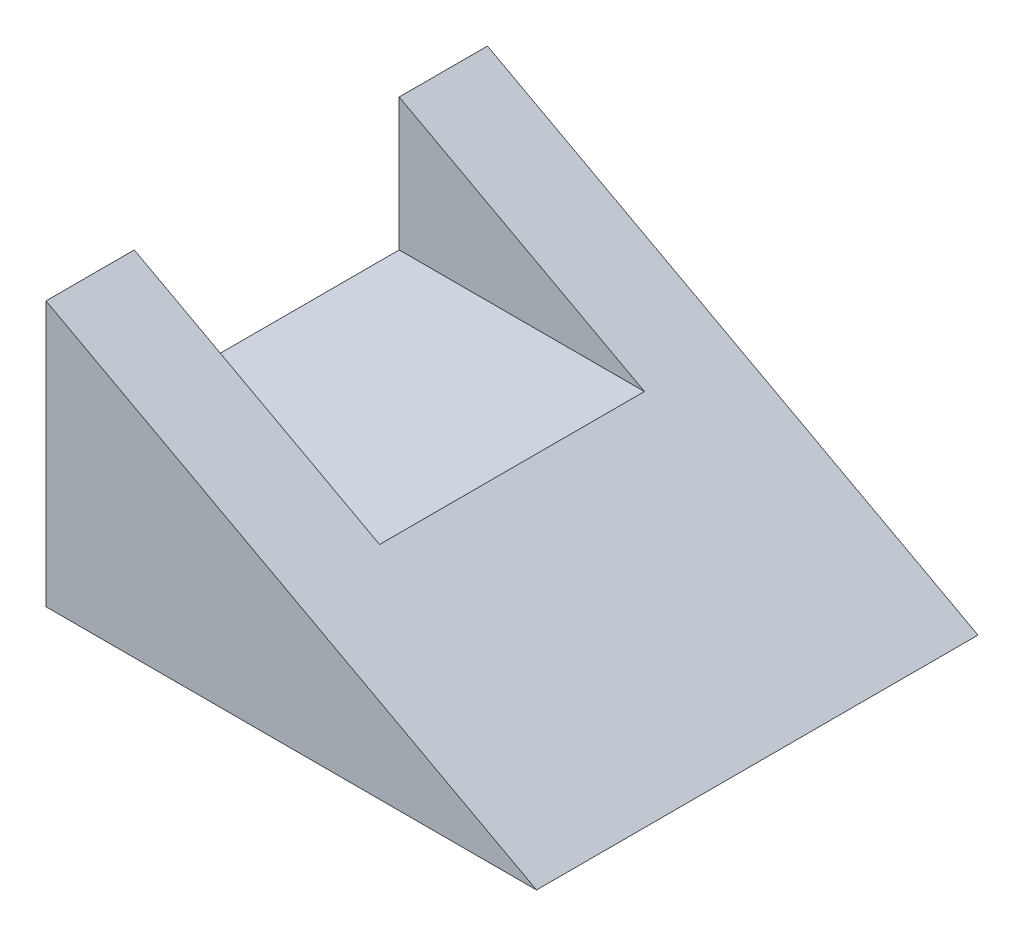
ISO-10303-21;
HEADER;
FILE_DESCRIPTION(('STEP AP214'),'2;1');
FILE_NAME('part.step','',(''),(''),'','','');
FILE_SCHEMA(('AUTOMOTIVE_DESIGN { 1 0 10303 214 1 1 1 1 }'));
ENDSEC;
DATA;
#1=APPLICATION_CONTEXT('core data for automotive mechanical design processes');
#2=APPLICATION_PROTOCOL_DEFINITION('international standard','automotive_design',2000,#1);
#3=PRODUCT_CONTEXT('',#1,'mechanical');
#4=PRODUCT('Part','Part','',(#3));
#5=PRODUCT_RELATED_PRODUCT_CATEGORY('part','',(#4));
#6=PRODUCT_DEFINITION_FORMATION('','',#4);
#7=PRODUCT_DEFINITION_CONTEXT('part definition',#1,'design');
#8=PRODUCT_DEFINITION('design','',#6,#7);
#9=PRODUCT_DEFINITION_SHAPE('','',#8);
#10=(LENGTH_UNIT() NAMED_UNIT(*) SI_UNIT(.MILLI.,.METRE.));
#11=(NAMED_UNIT(*) PLANE_ANGLE_UNIT() SI_UNIT($,.RADIAN.));
#12=(NAMED_UNIT(*) SI_UNIT($,.STERADIAN.) SOLID_ANGLE_UNIT());
#13=UNCERTAINTY_MEASURE_WITH_UNIT(LENGTH_MEASURE(1.E-05),#10,'distance_accuracy_value','');
#14=(GEOMETRIC_REPRESENTATION_CONTEXT(3) GLOBAL_UNCERTAINTY_ASSIGNED_CONTEXT((#13)) GLOBAL_UNIT_ASSIGNED_CONTEXT((#10,
#11,#12)) REPRESENTATION_CONTEXT('',''));
#15=CARTESIAN_POINT('',(0.,0.,0.));
#16=DIRECTION('',(0.,0.,1.));
#17=DIRECTION('',(1.,0.,0.));
#18=AXIS2_PLACEMENT_3D('',#15,#16,#17);
#19=CARTESIAN_POINT('',(50.,0.,45.));
#20=DIRECTION('',(0.,1.,0.));
#21=DIRECTION('',(-1.,0.,0.));
#22=AXIS2_PLACEMENT_3D('',#19,#20,#21);
#23=PLANE('',#22);
#24=DIRECTION('',(1.,0.,0.));
#25=VECTOR('',#24,1.);
#26=CARTESIAN_POINT('',(50.,0.,0.));
#27=LINE('',#26,#25);
#28=CARTESIAN_POINT('',(0.,0.,0.));
#29=VERTEX_POINT('',#28);
#30=CARTESIAN_POINT('',(50.,0.,0.));
#31=VERTEX_POINT('',#30);
#32=EDGE_CURVE('E110',#29,#31,#27,.T.);
#33=ORIENTED_EDGE('',*,*,#32,.T.);
#34=DIRECTION('',(0.,0.,-1.));
#35=VECTOR('',#34,1.);
#36=CARTESIAN_POINT('',(50.,0.,45.));
#37=LINE('',#36,#35);
#38=CARTESIAN_POINT('',(50.,0.,45.));
#39=VERTEX_POINT('',#38);
#40=EDGE_CURVE('E38',#39,#31,#37,.T.);
#41=ORIENTED_EDGE('',*,*,#40,.F.);
#42=DIRECTION('',(1.,0.,0.));
#43=VECTOR('',#42,1.);
#44=CARTESIAN_POINT('',(50.,0.,45.));
#45=LINE('',#44,#43);
#46=CARTESIAN_POINT('',(0.,0.,45.));
#47=VERTEX_POINT('',#46);
#48=EDGE_CURVE('E118',#47,#39,#45,.T.);
#49=ORIENTED_EDGE('',*,*,#48,.F.);
#50=DIRECTION('',(0.,0.,-1.));
#51=VECTOR('',#50,1.);
#52=CARTESIAN_POINT('',(0.,0.,45.));
#53=LINE('',#52,#51);
#54=EDGE_CURVE('E123',#47,#29,#53,.T.);
#55=ORIENTED_EDGE('',*,*,#54,.T.);
#56=EDGE_LOOP('',(#33,#41,#49,#55));
#57=FACE_BOUND('',#56,.T.);
#58=ADVANCED_FACE('F31',(#57),#23,.F.);
#59=CARTESIAN_POINT('',(0.,27.,45.));
#60=DIRECTION('',(-0.475148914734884,-0.879905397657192,0.));
#61=DIRECTION('',(0.879905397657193,-0.475148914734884,0.));
#62=AXIS2_PLACEMENT_3D('',#59,#60,#61);
#63=PLANE('',#62);
#64=DIRECTION('',(0.,0.,-1.));
#65=VECTOR('',#64,1.);
#66=CARTESIAN_POINT('',(0.,27.,45.));
#67=LINE('',#66,#65);
#68=CARTESIAN_POINT('',(0.,27.,9.));
#69=VERTEX_POINT('',#68);
#70=CARTESIAN_POINT('',(0.,27.,0.));
#71=VERTEX_POINT('',#70);
#72=EDGE_CURVE('E126',#69,#71,#67,.T.);
#73=ORIENTED_EDGE('',*,*,#72,.F.);
#74=DIRECTION('',(0.879905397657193,-0.475148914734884,0.));
#75=VECTOR('',#74,1.);
#76=CARTESIAN_POINT('',(0.,27.,9.));
#77=LINE('',#76,#75);
#78=CARTESIAN_POINT('',(25.,13.5,9.));
#79=VERTEX_POINT('',#78);
#80=EDGE_CURVE('E107',#69,#79,#77,.T.);
#81=ORIENTED_EDGE('',*,*,#80,.T.);
#82=DIRECTION('',(0.,0.,1.));
#83=VECTOR('',#82,1.);
#84=CARTESIAN_POINT('',(25.,13.5,45.));
#85=LINE('',#84,#83);
#86=CARTESIAN_POINT('',(25.,13.5,36.));
#87=VERTEX_POINT('',#86);
#88=EDGE_CURVE('E91',#79,#87,#85,.T.);
#89=ORIENTED_EDGE('',*,*,#88,.T.);
#90=DIRECTION('',(-0.879905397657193,0.475148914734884,0.));
#91=VECTOR('',#90,1.);
#92=CARTESIAN_POINT('',(0.,27.,36.));
#93=LINE('',#92,#91);
#94=CARTESIAN_POINT('',(0.,27.,36.));
#95=VERTEX_POINT('',#94);
#96=EDGE_CURVE('E89',#87,#95,#93,.T.);
#97=ORIENTED_EDGE('',*,*,#96,.T.);
#98=CARTESIAN_POINT('',(0.,27.,45.));
#99=VERTEX_POINT('',#98);
#100=EDGE_CURVE('E101',#99,#95,#67,.T.);
#101=ORIENTED_EDGE('',*,*,#100,.F.);
#102=DIRECTION('',(-0.879905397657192,0.475148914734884,0.));
#103=VECTOR('',#102,1.);
#104=CARTESIAN_POINT('',(0.,27.,45.));
#105=LINE('',#104,#103);
#106=EDGE_CURVE('E120',#39,#99,#105,.T.);
#107=ORIENTED_EDGE('',*,*,#106,.F.);
#108=ORIENTED_EDGE('',*,*,#40,.T.);
#109=DIRECTION('',(-0.879905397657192,0.475148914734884,0.));
#110=VECTOR('',#109,1.);
#111=CARTESIAN_POINT('',(0.,27.,0.));
#112=LINE('',#111,#110);
#113=EDGE_CURVE('E113',#31,#71,#112,.T.);
#114=ORIENTED_EDGE('',*,*,#113,.T.);
#115=EDGE_LOOP('',(#73,#81,#89,#97,#101,#107,#108,#114));
#116=FACE_BOUND('',#115,.T.);
#117=ADVANCED_FACE('F131',(#116),#63,.F.);
#118=CARTESIAN_POINT('',(0.,0.,45.));
#119=DIRECTION('',(1.,0.,0.));
#120=DIRECTION('',(0.,0.,-1.));
#121=AXIS2_PLACEMENT_3D('',#118,#119,#120);
#122=PLANE('',#121);
#123=DIRECTION('',(0.,0.,1.));
#124=VECTOR('',#123,1.);
#125=CARTESIAN_POINT('',(0.,13.5,9.));
#126=LINE('',#125,#124);
#127=CARTESIAN_POINT('',(0.,13.5,9.));
#128=VERTEX_POINT('',#127);
#129=CARTESIAN_POINT('',(0.,13.5,36.));
#130=VERTEX_POINT('',#129);
#131=EDGE_CURVE('E94',#128,#130,#126,.T.);
#132=ORIENTED_EDGE('',*,*,#131,.F.);
#133=DIRECTION('',(0.,1.,0.));
#134=VECTOR('',#133,1.);
#135=CARTESIAN_POINT('',(0.,0.,9.00000000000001));
#136=LINE('',#135,#134);
#137=EDGE_CURVE('E11',#128,#69,#136,.T.);
#138=ORIENTED_EDGE('',*,*,#137,.T.);
#139=ORIENTED_EDGE('',*,*,#72,.T.);
#140=DIRECTION('',(0.,-1.,0.));
#141=VECTOR('',#140,1.);
#142=CARTESIAN_POINT('',(0.,0.,0.));
#143=LINE('',#142,#141);
#144=EDGE_CURVE('E116',#71,#29,#143,.T.);
#145=ORIENTED_EDGE('',*,*,#144,.T.);
#146=ORIENTED_EDGE('',*,*,#54,.F.);
#147=DIRECTION('',(0.,-1.,0.));
#148=VECTOR('',#147,1.);
#149=CARTESIAN_POINT('',(0.,0.,45.));
#150=LINE('',#149,#148);
#151=EDGE_CURVE('E53',#99,#47,#150,.T.);
#152=ORIENTED_EDGE('',*,*,#151,.F.);
#153=ORIENTED_EDGE('',*,*,#100,.T.);
#154=DIRECTION('',(0.,1.,0.));
#155=VECTOR('',#154,1.);
#156=CARTESIAN_POINT('',(0.,28.8571428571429,36.));
#157=LINE('',#156,#155);
#158=EDGE_CURVE('E87',#130,#95,#157,.T.);
#159=ORIENTED_EDGE('',*,*,#158,.F.);
#160=EDGE_LOOP('',(#132,#138,#139,#145,#146,#152,#153,#159));
#161=FACE_BOUND('',#160,.T.);
#162=ADVANCED_FACE('F99',(#161),#122,.F.);
#163=CARTESIAN_POINT('',(0.,0.,45.));
#164=DIRECTION('',(0.,0.,-1.));
#165=DIRECTION('',(-1.,0.,0.));
#166=AXIS2_PLACEMENT_3D('',#163,#164,#165);
#167=PLANE('',#166);
#168=ORIENTED_EDGE('',*,*,#48,.T.);
#169=ORIENTED_EDGE('',*,*,#106,.T.);
#170=ORIENTED_EDGE('',*,*,#151,.T.);
#171=EDGE_LOOP('',(#168,#169,#170));
#172=FACE_BOUND('',#171,.T.);
#173=ADVANCED_FACE('F147',(#172),#167,.F.);
#174=CARTESIAN_POINT('',(0.,0.,0.));
#175=DIRECTION('',(0.,0.,-1.));
#176=DIRECTION('',(-1.,0.,0.));
#177=AXIS2_PLACEMENT_3D('',#174,#175,#176);
#178=PLANE('',#177);
#179=ORIENTED_EDGE('',*,*,#32,.F.);
#180=ORIENTED_EDGE('',*,*,#144,.F.);
#181=ORIENTED_EDGE('',*,*,#113,.F.);
#182=EDGE_LOOP('',(#179,#180,#181));
#183=FACE_BOUND('',#182,.T.);
#184=ADVANCED_FACE('F137',(#183),#178,.T.);
#185=CARTESIAN_POINT('',(50.,28.857142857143,9.));
#186=DIRECTION('',(0.,0.,-1.));
#187=DIRECTION('',(0.,1.,0.));
#188=AXIS2_PLACEMENT_3D('',#185,#186,#187);
#189=PLANE('',#188);
#190=ORIENTED_EDGE('',*,*,#137,.F.);
#191=DIRECTION('',(-1.,0.,0.));
#192=VECTOR('',#191,1.);
#193=CARTESIAN_POINT('',(50.,13.5,9.));
#194=LINE('',#193,#192);
#195=EDGE_CURVE('E45',#79,#128,#194,.T.);
#196=ORIENTED_EDGE('',*,*,#195,.F.);
#197=ORIENTED_EDGE('',*,*,#80,.F.);
#198=EDGE_LOOP('',(#190,#196,#197));
#199=FACE_BOUND('',#198,.T.);
#200=ADVANCED_FACE('F139',(#199),#189,.F.);
#201=CARTESIAN_POINT('',(50.,28.8571428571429,36.));
#202=DIRECTION('',(0.,0.,1.));
#203=DIRECTION('',(1.,0.,0.));
#204=AXIS2_PLACEMENT_3D('',#201,#202,#203);
#205=PLANE('',#204);
#206=DIRECTION('',(-1.,0.,0.));
#207=VECTOR('',#206,1.);
#208=CARTESIAN_POINT('',(50.,13.5,36.));
#209=LINE('',#208,#207);
#210=EDGE_CURVE('E84',#87,#130,#209,.T.);
#211=ORIENTED_EDGE('',*,*,#210,.T.);
#212=ORIENTED_EDGE('',*,*,#158,.T.);
#213=ORIENTED_EDGE('',*,*,#96,.F.);
#214=EDGE_LOOP('',(#211,#212,#213));
#215=FACE_BOUND('',#214,.T.);
#216=ADVANCED_FACE('F85',(#215),#205,.F.);
#217=CARTESIAN_POINT('',(50.,13.5,9.));
#218=DIRECTION('',(0.,-1.,0.));
#219=DIRECTION('',(0.,0.,-1.));
#220=AXIS2_PLACEMENT_3D('',#217,#218,#219);
#221=PLANE('',#220);
#222=ORIENTED_EDGE('',*,*,#195,.T.);
#223=ORIENTED_EDGE('',*,*,#131,.T.);
#224=ORIENTED_EDGE('',*,*,#210,.F.);
#225=ORIENTED_EDGE('',*,*,#88,.F.);
#226=EDGE_LOOP('',(#222,#223,#224,#225));
#227=FACE_BOUND('',#226,.T.);
#228=ADVANCED_FACE('F95',(#227),#221,.F.);
#229=CLOSED_SHELL('',(#58,#117,#162,#173,#184,#200,#216,#228));
#230=MANIFOLD_SOLID_BREP('B2',#229);
#231=ADVANCED_BREP_SHAPE_REPRESENTATION('',(#18,#230),#14);
#232=SHAPE_DEFINITION_REPRESENTATION(#9,#231);
ENDSEC;
END-ISO-10303-21;
